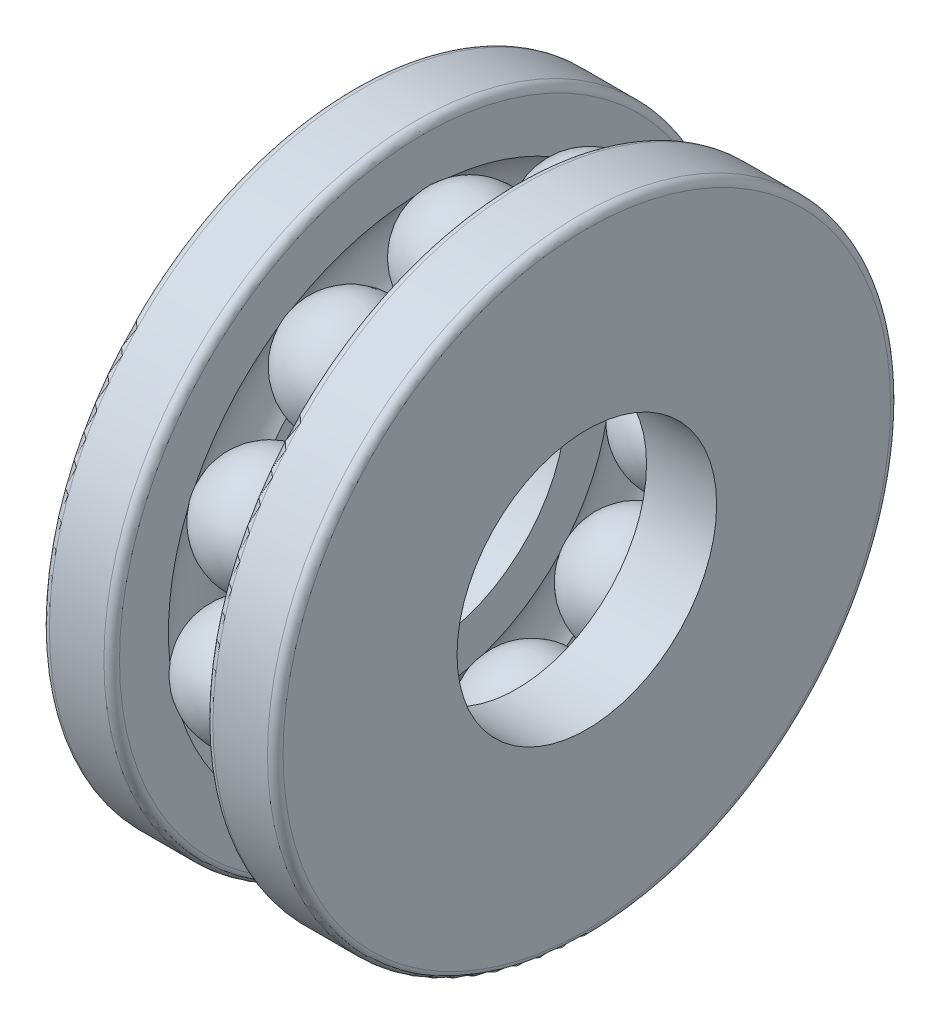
from build123d import *

# Parameters (mm, degrees)
CIRCULAR_PATTERN1_COUNT = 11
FILLET1_R               = 0.3


with BuildPart() as part:
    # Sketch1 → Revolve1 (revolve)
    with BuildSketch(Plane(origin=(0, 0, 0), x_dir=(0, 1, 0), z_dir=(0, 0, 1))):
        with BuildLine():
            Line((6.25, 0), (10.75, 0))
            ThreePointArc((10.75, 0), (8.5, -2.25), (6.25, 0))
        make_face()
    revolve1 = revolve(axis=Axis((0, 4.377607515, 0), (0, 1, 0)))

    # Sketch2 → Revolve2 (revolve)
    with BuildSketch(Plane(origin=(0, 0, 0), x_dir=(0, 1, 0), z_dir=(0, 0, 1)), mode=Mode.PRIVATE) as revolve2_sk:
        with BuildLine():
            Line((5.5, 4.5), (5.5, 1.8))
            Line((5.5, 1.8), (7.183603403, 1.8))
            ThreePointArc((7.183603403, 1.8), (8.5, 2.23), (9.816396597, 1.8))
            Line((9.816396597, 1.8), (12, 1.8))
            Line((12, 1.8), (12, 4.5))
            Line((12, 4.5), (5.5, 4.5))
        make_face()
    revolve(revolve2_sk.sketch.rotate(Axis((-4.873642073, 0, 0), (1, 0, 0)), 90), axis=Axis((-4.873642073, 0, 0), (1, 0, 0)))

    # Sketch3 → Revolve3 (revolve)
    with BuildSketch(Plane(origin=(0, 0, 0), x_dir=(0, 1, 0), z_dir=(0, 0, 1)), mode=Mode.PRIVATE) as revolve3_sk:
        with BuildLine():
            Line((5, -1.8), (7.183603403, -1.8))
            ThreePointArc((7.183603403, -1.8), (8.5, -2.23), (9.816396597, -1.8))
            Line((9.816396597, -1.8), (12, -1.8))
            Line((12, -1.8), (12, -4.5))
            Line((12, -4.5), (5, -4.5))
            Line((5, -4.5), (5, -1.8))
        make_face()
    revolve(revolve3_sk.sketch.rotate(Axis((-8.725907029, 0, 0), (1, 0, 0)), 90), axis=Axis((-8.725907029, 0, 0), (1, 0, 0)))

    # Circular-Pattern1: Revolve1 ×11 about axis
    circular_pattern1_axis = Axis((0, 0, 0), (1, 0, 0))
    for i in range(1, CIRCULAR_PATTERN1_COUNT):
        add(revolve1.rotate(circular_pattern1_axis, i * 360 / CIRCULAR_PATTERN1_COUNT))

    # Fillet1
    fillet1_edges = [part.edges().sort_by_distance(p)[0] for p in [
        (4.5, 0, -12),
        (1.8, 0, -12),
        (-4.5, 0, -12),
        (-1.8, 0, -12),
    ]]
    fillet(fillet1_edges, radius=FILLET1_R)


solid = part.part
